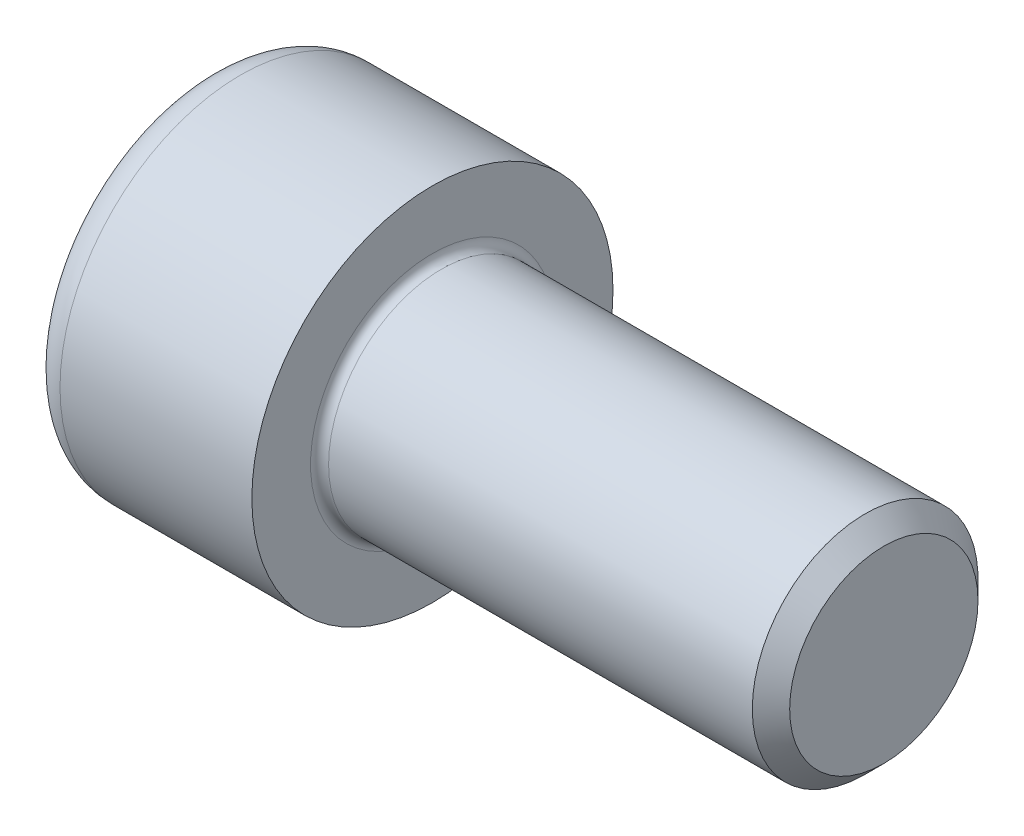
from build123d import *

# Parameters (mm, degrees)
FILLET1_R   = 0.4
FILLET2_R   = 1.5
HEX_2_DEPTH = 5


with BuildPart() as part:
    # BodySke → Base-Revolve (revolve)
    with BuildSketch(Plane.XY, mode=Mode.PRIVATE) as base_revolve_sk:
        Polygon((0, 0), (0, 8), (10, 8), (10, 5), (29.172, 5), (30, 4.172), (30, 0), align=None)
    revolve(base_revolve_sk.sketch.rotate(Axis((-31.75, 0, 0), (1, 0, 0)), 90), axis=Axis((-31.75, 0, 0), (1, 0, 0)))

    # Fillet1
    fillet1_edges = [part.edges().sort_by_distance(p)[0] for p in [
        (10, 0, -5),
    ]]
    fillet(fillet1_edges, radius=FILLET1_R)

    # Fillet2
    fillet2_edges = [part.edges().sort_by_distance(p)[0] for p in [
        (0, 0, -8),
    ]]
    fillet(fillet2_edges, radius=FILLET2_R)

    # Sketch2 → Hex-PreBroach (revolve, cut)
    with BuildSketch(Plane.XY, mode=Mode.PRIVATE) as hex_prebroach_sk:
        Polygon((0, 4.0575), (5, 4.0575), (7.342598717, 0), (0, 0), align=None)
    revolve(hex_prebroach_sk.sketch.rotate(Axis((0, 0, 0), (1, 0, 0)), 90), axis=Axis((0, 0, 0), (1, 0, 0)), mode=Mode.SUBTRACT)

    # Sketch3 → Hex 2 (cut)
    with BuildSketch(Plane(origin=(0, 0, 0), x_dir=(0, 0.500000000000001, 0.866025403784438), z_dir=(-1, 0, 0))):
        Polygon((2.342598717, 4.0575), (-2.342598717, 4.0575), (-4.685197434, 0), (-2.342598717, -4.0575), (2.342598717, -4.0575), (4.685197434, 0), align=None)
    extrude(amount=-HEX_2_DEPTH, mode=Mode.SUBTRACT)


solid = part.part
